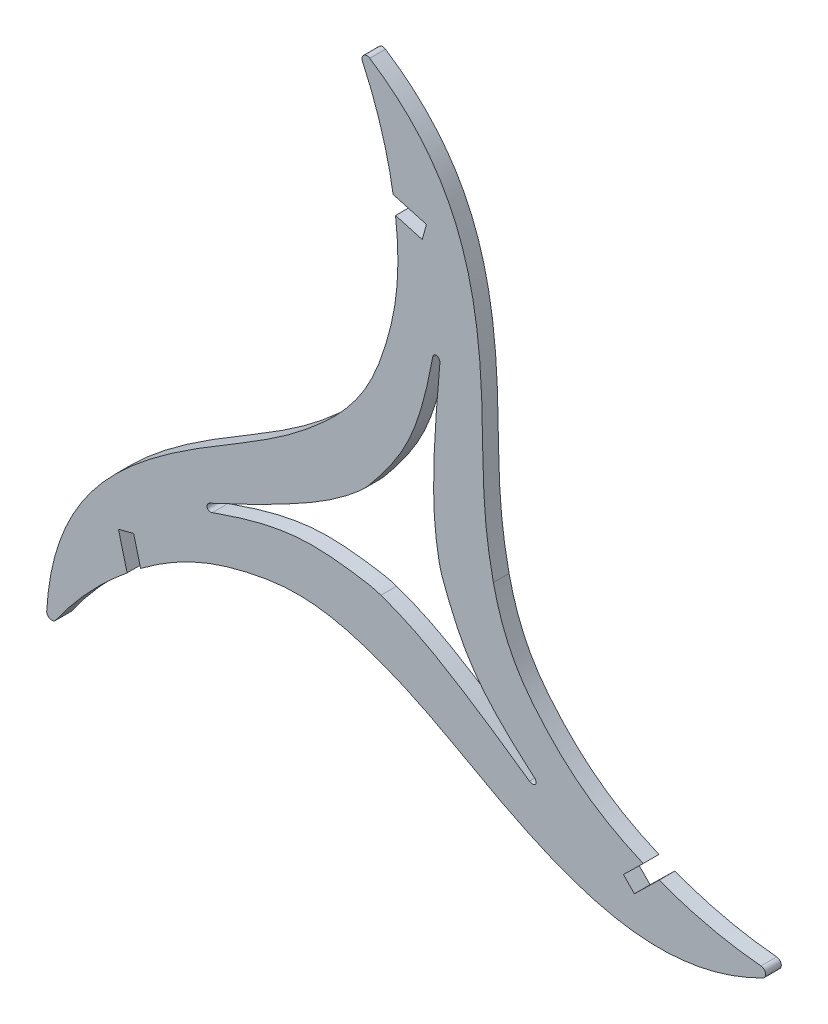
from build123d import *

# Parameters (mm, degrees)
AUFSATZ_LINEAR_AUSTRAGEN1_DEPTH = 1.5875


with BuildPart() as part:
    # Skizze1 → Aufsatz-Linear austragen1 (new, symmetric)
    with BuildSketch(Plane.XY):
        with BuildLine():
            Line((2.469022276, 59.578581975), (9.209195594, 57.698818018))
            Line((9.209195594, 57.698818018), (8.356270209, 54.640527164))
            Line((8.356270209, 54.640527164), (2.961216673, 56.145151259))
            add(Edge.make_bspline(
                [(-11.382618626, 12.897968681), (-4.039091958, 19.620050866), (1.284862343, 31.046779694), (4.104906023, 44.911640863), (3.078608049, 55.170632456), (2.961216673, 56.145151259)],
                knots=[-8.318251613, -8.318251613, -8.318251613, -8.318251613, -7.318251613, -6.318251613, -6.215736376, -6.215736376, -6.215736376, -6.215736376], degree=3))
            add(Edge.make_bspline(
                [(-67.550520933, -48.384421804), (-66.955221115, -37.455364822), (-59.322855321, -19.532921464), (-34.029484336, -2.122217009), (-19.383544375, 5.574119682), (-11.382618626, 12.897968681)],
                knots=[-11.219945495, -11.219945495, -11.219945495, -11.219945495, -10.318251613, -9.318251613, -8.318251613, -8.318251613, -8.318251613, -8.318251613], degree=3))
            add(Edge.make_bspline(
                [(-66.862884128, -49.40166785), (-67.592427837, -49.153786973), (-67.550520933, -48.384421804)],
                knots=[0, 0, 0, 0.051907, 0.051907, 0.051907], degree=2, weights=[1, 0.796786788, 1]))
            add(Edge.make_bspline(
                [(-65.69786165, -49.013909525), (-66.133340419, -49.649548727), (-66.862884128, -49.40166785)],
                knots=[0, 0, 0, 0.051907, 0.051907, 0.051907], degree=2, weights=[1, 0.796786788, 1]))
            add(Edge.make_bspline(
                [(-51.303617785, -33.558362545), (-59.570657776, -40.289687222), (-65.69786165, -49.013909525)],
                knots=[0, 0, 0, 0.834137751, 0.834137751, 0.834137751], degree=2, weights=[1, 0.990551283, 1]))
            Line((-51.303617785, -33.558362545), (-53.045781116, -26.781319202))
            Line((-53.045781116, -26.781319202), (-49.970760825, -25.990828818))
            Line((-49.970760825, -25.990828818), (-48.576276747, -31.415394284))
            add(Edge.make_bspline(
                [(-3.951200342, -22.213928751), (-13.444457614, -19.215289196), (-26.002272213, -20.317973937), (-39.419616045, -24.808175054), (-47.791014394, -30.826470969), (-48.576276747, -31.415394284)],
                knots=[-14.713230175, -14.713230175, -14.713230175, -14.713230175, -13.713230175, -12.713230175, -12.610714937, -12.610714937, -12.610714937, -12.610714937], degree=3))
            add(Edge.make_bspline(
                [(77.204857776, -40.215563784), (67.442366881, -45.16454751), (48.104892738, -47.51594652), (20.38009489, -34.316596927), (6.391901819, -25.481009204), (-3.951200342, -22.213928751)],
                knots=[-17.614924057, -17.614924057, -17.614924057, -17.614924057, -16.713230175, -15.713230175, -14.713230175, -14.713230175, -14.713230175, -14.713230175], degree=3))
            add(Edge.make_bspline(
                [(77.742000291, -39.111429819), (77.892101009, -39.867173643), (77.204857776, -40.215563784)],
                knots=[0, 0, 0, 0.051907, 0.051907, 0.051907], degree=2, weights=[1, 0.796786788, 1]))
            add(Edge.make_bspline(
                [(76.823680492, -38.296369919), (77.591899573, -38.355685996), (77.742000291, -39.111429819)],
                knots=[0, 0, 0, 0.051907, 0.051907, 0.051907], degree=2, weights=[1, 0.796786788, 1]))
            add(Edge.make_bspline(
                [(56.241662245, -33.558362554), (66.204680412, -37.352166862), (76.823680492, -38.296369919)],
                knots=[0, 0, 0, 0.834137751, 0.834137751, 0.834137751], degree=2, weights=[1, 0.990551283, 1]))
            Line((56.241662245, -33.558362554), (51.243652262, -38.455641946))
            Line((51.243652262, -38.455641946), (49.021557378, -36.187841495))
            Line((49.021557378, -36.187841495), (53.02212681, -32.267900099))
            add(Edge.make_bspline(
                [(22.740885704, 1.777816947), (24.890616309, -7.942904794), (32.124476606, -18.266948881), (42.721776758, -27.641608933), (52.119473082, -31.882304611), (53.02212681, -32.267900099)],
                knots=[-21.108208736, -21.108208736, -21.108208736, -21.108208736, -20.108208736, -19.108208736, -19.005693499, -19.005693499, -19.005693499, -19.005693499], degree=3))
            add(Edge.make_bspline(
                [(-2.247270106, 81.061842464), (6.91992097, 75.081769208), (18.625029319, 59.510724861), (21.056456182, 28.900670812), (20.398709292, 12.368746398), (22.740885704, 1.777816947)],
                knots=[-24.009902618, -24.009902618, -24.009902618, -24.009902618, -23.108208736, -22.108208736, -21.108208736, -21.108208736, -21.108208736, -21.108208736], degree=3))
            add(Edge.make_bspline(
                [(-3.472049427, 80.974954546), (-2.892606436, 81.482817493), (-2.247270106, 81.061842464)],
                knots=[0, 0, 0, 0.051907, 0.051907, 0.051907], degree=2, weights=[1, 0.796786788, 1]))
            add(Edge.make_bspline(
                [(-3.718752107, 79.772136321), (-4.051492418, 80.467091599), (-3.472049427, 80.974954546)],
                knots=[0, 0, 0, 0.051907, 0.051907, 0.051907], degree=2, weights=[1, 0.796786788, 1]))
            add(Edge.make_bspline(
                [(2.469022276, 59.578581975), (0.7730441, 70.10371096), (-3.718752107, 79.772136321)],
                knots=[0, 0, 0, 0.834137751, 0.834137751, 0.834137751], degree=2, weights=[1, 0.990551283, 1]))
        make_face()
        with BuildLine():
            add(Edge.make_bspline(
                [(-4.352149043, 4.276472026), (-9.300615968, 0.006013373), (-15.060509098, -3.942628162), (-34.544861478, -12.967383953)],
                knots=[6.951511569, 6.951511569, 6.951511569, 6.951511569, 7.552775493, 7.552775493, 7.552775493, 7.552775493], degree=3))
            add(Edge.make_bspline(
                [(-34.544861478, -12.967383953), (-34.682042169, -13.03092326), (-35.747154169, -13.526113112), (-35.305702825, -14.892125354), (-34.229051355, -14.435633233), (-34.08284298, -14.383745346)],
                knots=[0, 0, 0, 0, 0, 0, 1, 1, 1, 1, 1, 1], degree=5))
            add(Edge.make_bspline(
                [(-34.08284298, -14.383745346), (-20.057263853, -9.406207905), (-13.089146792, -9.503341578), (-1.771025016, -11.197662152), (0, -11.81461529)],
                knots=[1, 1, 1, 1, 1.75896553, 1.916327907, 1.916327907, 1.916327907, 1.916327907], degree=3))
            add(Edge.make_bspline(
                [(0, -11.81461529), (6.172559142, -13.96488403), (12.472129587, -16.978777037), (30.029973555, -29.340343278)],
                knots=[1.916327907, 1.916327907, 1.916327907, 1.916327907, 2.517591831, 2.517591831, 2.517591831, 2.517591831], degree=3))
            add(Edge.make_bspline(
                [(30.029973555, -29.340343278), (30.153590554, -29.427375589), (31.114993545, -30.102194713), (32.077269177, -29.036880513), (31.143609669, -28.33271905), (31.025569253, -28.232042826)],
                knots=[2.517591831, 2.517591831, 2.517591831, 2.517591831, 2.517591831, 2.517591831, 3.517591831, 3.517591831, 3.517591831, 3.517591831, 3.517591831, 3.517591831], degree=5))
            add(Edge.make_bspline(
                [(31.025569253, -28.232042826), (19.702105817, -18.574303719), (16.302167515, -12.491170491), (12.110431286, -1.842229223), (11.759215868, 0)],
                knots=[3.517591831, 3.517591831, 3.517591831, 3.517591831, 4.276557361, 4.433919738, 4.433919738, 4.433919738, 4.433919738], degree=3))
            add(Edge.make_bspline(
                [(11.759215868, 0), (10.535123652, 6.420727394), (9.995446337, 13.383261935), (11.921954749, 34.769583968)],
                knots=[4.433919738, 4.433919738, 4.433919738, 4.433919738, 5.035183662, 5.035183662, 5.035183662, 5.035183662], degree=3))
            add(Edge.make_bspline(
                [(11.921954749, 34.769583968), (11.935518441, 34.920155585), (12.03922745, 36.09016456), (10.635500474, 36.390862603), (10.492508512, 35.230209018), (10.464340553, 35.077644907)],
                knots=[5.035183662, 5.035183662, 5.035183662, 5.035183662, 5.035183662, 5.035183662, 6.035183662, 6.035183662, 6.035183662, 6.035183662, 6.035183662, 6.035183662], degree=5))
            add(Edge.make_bspline(
                [(10.464340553, 35.077644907), (7.762224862, 20.442368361), (4.194046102, 14.456368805), (-2.932339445, 5.501748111), (-4.352149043, 4.276472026)],
                knots=[6.035183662, 6.035183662, 6.035183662, 6.035183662, 6.794149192, 6.951511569, 6.951511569, 6.951511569, 6.951511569], degree=3))
        make_face(mode=Mode.SUBTRACT)
    extrude(amount=AUFSATZ_LINEAR_AUSTRAGEN1_DEPTH, both=True)


solid = part.part
